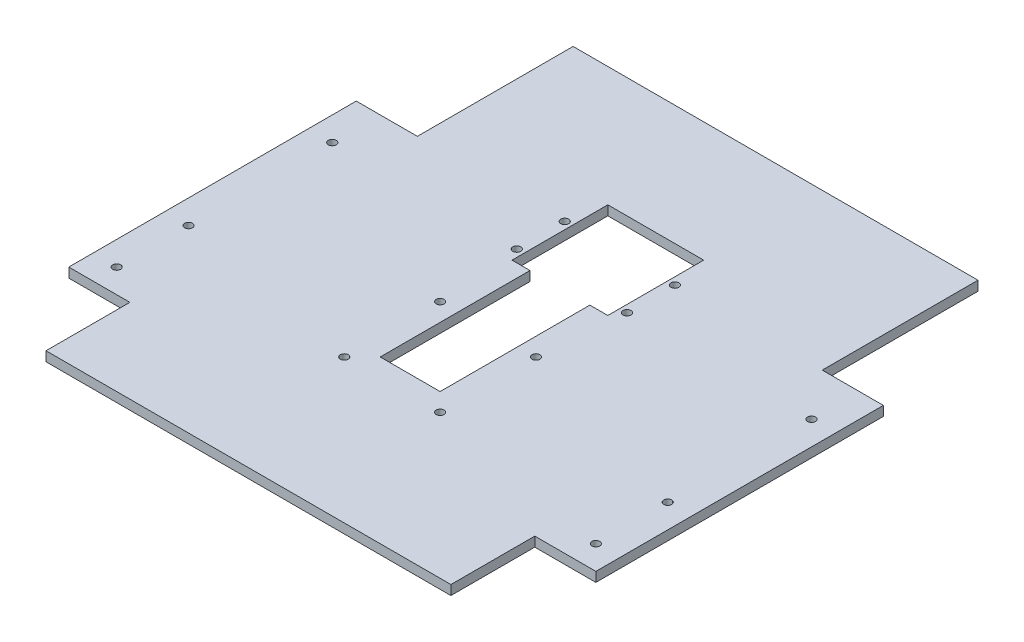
ISO-10303-21;
HEADER;
FILE_DESCRIPTION(('STEP AP214'),'2;1');
FILE_NAME('part.step','',(''),(''),'','','');
FILE_SCHEMA(('AUTOMOTIVE_DESIGN { 1 0 10303 214 1 1 1 1 }'));
ENDSEC;
DATA;
#1=APPLICATION_CONTEXT('core data for automotive mechanical design processes');
#2=APPLICATION_PROTOCOL_DEFINITION('international standard','automotive_design',2000,#1);
#3=PRODUCT_CONTEXT('',#1,'mechanical');
#4=PRODUCT('Part','Part','',(#3));
#5=PRODUCT_RELATED_PRODUCT_CATEGORY('part','',(#4));
#6=PRODUCT_DEFINITION_FORMATION('','',#4);
#7=PRODUCT_DEFINITION_CONTEXT('part definition',#1,'design');
#8=PRODUCT_DEFINITION('design','',#6,#7);
#9=PRODUCT_DEFINITION_SHAPE('','',#8);
#10=(LENGTH_UNIT() NAMED_UNIT(*) SI_UNIT(.MILLI.,.METRE.));
#11=(NAMED_UNIT(*) PLANE_ANGLE_UNIT() SI_UNIT($,.RADIAN.));
#12=(NAMED_UNIT(*) SI_UNIT($,.STERADIAN.) SOLID_ANGLE_UNIT());
#13=UNCERTAINTY_MEASURE_WITH_UNIT(LENGTH_MEASURE(1.E-05),#10,'distance_accuracy_value','');
#14=(GEOMETRIC_REPRESENTATION_CONTEXT(3) GLOBAL_UNCERTAINTY_ASSIGNED_CONTEXT((#13)) GLOBAL_UNIT_ASSIGNED_CONTEXT((#10,
#11,#12)) REPRESENTATION_CONTEXT('',''));
#15=CARTESIAN_POINT('',(0.,0.,0.));
#16=DIRECTION('',(0.,0.,1.));
#17=DIRECTION('',(1.,0.,0.));
#18=AXIS2_PLACEMENT_3D('',#15,#16,#17);
#19=CARTESIAN_POINT('',(0.,-146.,42.5));
#20=DIRECTION('',(0.,0.,1.));
#21=DIRECTION('',(1.,0.,0.));
#22=AXIS2_PLACEMENT_3D('',#19,#20,#21);
#23=PLANE('',#22);
#24=DIRECTION('',(-1.,0.,0.));
#25=VECTOR('',#24,1.);
#26=CARTESIAN_POINT('',(0.,0.,42.5));
#27=LINE('',#26,#25);
#28=CARTESIAN_POINT('',(12.5,0.,42.5));
#29=VERTEX_POINT('',#28);
#30=CARTESIAN_POINT('',(-12.5,0.,42.5));
#31=VERTEX_POINT('',#30);
#32=EDGE_CURVE('E430',#29,#31,#27,.T.);
#33=ORIENTED_EDGE('',*,*,#32,.T.);
#34=DIRECTION('',(0.,1.,0.));
#35=VECTOR('',#34,1.);
#36=CARTESIAN_POINT('',(-12.5,-146.,42.5));
#37=LINE('',#36,#35);
#38=CARTESIAN_POINT('',(-12.5,4.,42.5));
#39=VERTEX_POINT('',#38);
#40=EDGE_CURVE('E26',#31,#39,#37,.T.);
#41=ORIENTED_EDGE('',*,*,#40,.T.);
#42=DIRECTION('',(1.,0.,0.));
#43=VECTOR('',#42,1.);
#44=CARTESIAN_POINT('',(0.,4.,42.5));
#45=LINE('',#44,#43);
#46=CARTESIAN_POINT('',(12.5,4.,42.5));
#47=VERTEX_POINT('',#46);
#48=EDGE_CURVE('E393',#39,#47,#45,.T.);
#49=ORIENTED_EDGE('',*,*,#48,.T.);
#50=DIRECTION('',(0.,1.,0.));
#51=VECTOR('',#50,1.);
#52=CARTESIAN_POINT('',(12.5,-146.,42.5));
#53=LINE('',#52,#51);
#54=EDGE_CURVE('E11',#29,#47,#53,.T.);
#55=ORIENTED_EDGE('',*,*,#54,.F.);
#56=EDGE_LOOP('',(#33,#41,#49,#55));
#57=FACE_BOUND('',#56,.T.);
#58=ADVANCED_FACE('F17',(#57),#23,.F.);
#59=CARTESIAN_POINT('',(12.5,-146.,0.));
#60=DIRECTION('',(1.,0.,0.));
#61=DIRECTION('',(0.,0.,1.));
#62=AXIS2_PLACEMENT_3D('',#59,#60,#61);
#63=PLANE('',#62);
#64=DIRECTION('',(0.,0.,1.));
#65=VECTOR('',#64,1.);
#66=CARTESIAN_POINT('',(12.5,0.,0.));
#67=LINE('',#66,#65);
#68=CARTESIAN_POINT('',(12.5,0.,-20.));
#69=VERTEX_POINT('',#68);
#70=EDGE_CURVE('E271',#69,#29,#67,.T.);
#71=ORIENTED_EDGE('',*,*,#70,.T.);
#72=ORIENTED_EDGE('',*,*,#54,.T.);
#73=DIRECTION('',(0.,0.,-1.));
#74=VECTOR('',#73,1.);
#75=CARTESIAN_POINT('',(12.5,4.,0.));
#76=LINE('',#75,#74);
#77=CARTESIAN_POINT('',(12.5,4.,-20.));
#78=VERTEX_POINT('',#77);
#79=EDGE_CURVE('E288',#47,#78,#76,.T.);
#80=ORIENTED_EDGE('',*,*,#79,.T.);
#81=DIRECTION('',(0.,1.,0.));
#82=VECTOR('',#81,1.);
#83=CARTESIAN_POINT('',(12.5,0.,-20.));
#84=LINE('',#83,#82);
#85=EDGE_CURVE('E476',#69,#78,#84,.T.);
#86=ORIENTED_EDGE('',*,*,#85,.F.);
#87=EDGE_LOOP('',(#71,#72,#80,#86));
#88=FACE_BOUND('',#87,.T.);
#89=ADVANCED_FACE('F520',(#88),#63,.F.);
#90=CARTESIAN_POINT('',(-12.5,-146.,0.));
#91=DIRECTION('',(1.,0.,0.));
#92=DIRECTION('',(0.,1.,0.));
#93=AXIS2_PLACEMENT_3D('',#90,#91,#92);
#94=PLANE('',#93);
#95=DIRECTION('',(0.,1.,0.));
#96=VECTOR('',#95,1.);
#97=CARTESIAN_POINT('',(-12.5,0.,-20.));
#98=LINE('',#97,#96);
#99=CARTESIAN_POINT('',(-12.5,0.,-20.));
#100=VERTEX_POINT('',#99);
#101=CARTESIAN_POINT('',(-12.5,4.,-20.));
#102=VERTEX_POINT('',#101);
#103=EDGE_CURVE('E258',#100,#102,#98,.T.);
#104=ORIENTED_EDGE('',*,*,#103,.T.);
#105=DIRECTION('',(0.,0.,-1.));
#106=VECTOR('',#105,1.);
#107=CARTESIAN_POINT('',(-12.5,4.,0.));
#108=LINE('',#107,#106);
#109=EDGE_CURVE('E372',#39,#102,#108,.T.);
#110=ORIENTED_EDGE('',*,*,#109,.F.);
#111=ORIENTED_EDGE('',*,*,#40,.F.);
#112=DIRECTION('',(0.,0.,1.));
#113=VECTOR('',#112,1.);
#114=CARTESIAN_POINT('',(-12.5,0.,0.));
#115=LINE('',#114,#113);
#116=EDGE_CURVE('E426',#100,#31,#115,.T.);
#117=ORIENTED_EDGE('',*,*,#116,.F.);
#118=EDGE_LOOP('',(#104,#110,#111,#117));
#119=FACE_BOUND('',#118,.T.);
#120=ADVANCED_FACE('F498',(#119),#94,.T.);
#121=CARTESIAN_POINT('',(-20.,0.,-60.));
#122=DIRECTION('',(0.,0.,-1.));
#123=DIRECTION('',(0.,-1.,0.));
#124=AXIS2_PLACEMENT_3D('',#121,#122,#123);
#125=PLANE('',#124);
#126=DIRECTION('',(-1.,0.,0.));
#127=VECTOR('',#126,1.);
#128=CARTESIAN_POINT('',(-20.,4.,-60.));
#129=LINE('',#128,#127);
#130=CARTESIAN_POINT('',(20.,4.,-60.));
#131=VERTEX_POINT('',#130);
#132=CARTESIAN_POINT('',(-20.,4.,-60.));
#133=VERTEX_POINT('',#132);
#134=EDGE_CURVE('E384',#131,#133,#129,.T.);
#135=ORIENTED_EDGE('',*,*,#134,.T.);
#136=DIRECTION('',(0.,1.,0.));
#137=VECTOR('',#136,1.);
#138=CARTESIAN_POINT('',(-20.,0.,-60.));
#139=LINE('',#138,#137);
#140=CARTESIAN_POINT('',(-20.,0.,-60.));
#141=VERTEX_POINT('',#140);
#142=EDGE_CURVE('E39',#141,#133,#139,.T.);
#143=ORIENTED_EDGE('',*,*,#142,.F.);
#144=DIRECTION('',(-1.,0.,0.));
#145=VECTOR('',#144,1.);
#146=CARTESIAN_POINT('',(-20.,0.,-60.));
#147=LINE('',#146,#145);
#148=CARTESIAN_POINT('',(20.,0.,-60.));
#149=VERTEX_POINT('',#148);
#150=EDGE_CURVE('E259',#149,#141,#147,.T.);
#151=ORIENTED_EDGE('',*,*,#150,.F.);
#152=DIRECTION('',(0.,1.,0.));
#153=VECTOR('',#152,1.);
#154=CARTESIAN_POINT('',(20.,0.,-60.));
#155=LINE('',#154,#153);
#156=EDGE_CURVE('E470',#149,#131,#155,.T.);
#157=ORIENTED_EDGE('',*,*,#156,.T.);
#158=EDGE_LOOP('',(#135,#143,#151,#157));
#159=FACE_BOUND('',#158,.T.);
#160=ADVANCED_FACE('F508',(#159),#125,.F.);
#161=CARTESIAN_POINT('',(-20.,0.,-20.));
#162=DIRECTION('',(-1.,0.,0.));
#163=DIRECTION('',(0.,0.,1.));
#164=AXIS2_PLACEMENT_3D('',#161,#162,#163);
#165=PLANE('',#164);
#166=DIRECTION('',(0.,0.,1.));
#167=VECTOR('',#166,1.);
#168=CARTESIAN_POINT('',(-20.,4.,-20.));
#169=LINE('',#168,#167);
#170=CARTESIAN_POINT('',(-20.,4.,-20.));
#171=VERTEX_POINT('',#170);
#172=EDGE_CURVE('E380',#133,#171,#169,.T.);
#173=ORIENTED_EDGE('',*,*,#172,.T.);
#174=DIRECTION('',(0.,1.,0.));
#175=VECTOR('',#174,1.);
#176=CARTESIAN_POINT('',(-20.,0.,-20.));
#177=LINE('',#176,#175);
#178=CARTESIAN_POINT('',(-20.,0.,-20.));
#179=VERTEX_POINT('',#178);
#180=EDGE_CURVE('E193',#179,#171,#177,.T.);
#181=ORIENTED_EDGE('',*,*,#180,.F.);
#182=DIRECTION('',(0.,0.,1.));
#183=VECTOR('',#182,1.);
#184=CARTESIAN_POINT('',(-20.,0.,-20.));
#185=LINE('',#184,#183);
#186=EDGE_CURVE('E254',#141,#179,#185,.T.);
#187=ORIENTED_EDGE('',*,*,#186,.F.);
#188=ORIENTED_EDGE('',*,*,#142,.T.);
#189=EDGE_LOOP('',(#173,#181,#187,#188));
#190=FACE_BOUND('',#189,.T.);
#191=ADVANCED_FACE('F507',(#190),#165,.F.);
#192=CARTESIAN_POINT('',(-20.,0.,-20.));
#193=DIRECTION('',(0.,0.,1.));
#194=DIRECTION('',(1.,0.,0.));
#195=AXIS2_PLACEMENT_3D('',#192,#193,#194);
#196=PLANE('',#195);
#197=DIRECTION('',(1.,0.,0.));
#198=VECTOR('',#197,1.);
#199=CARTESIAN_POINT('',(-20.,0.,-20.));
#200=LINE('',#199,#198);
#201=CARTESIAN_POINT('',(20.,0.,-20.));
#202=VERTEX_POINT('',#201);
#203=EDGE_CURVE('E266',#69,#202,#200,.T.);
#204=ORIENTED_EDGE('',*,*,#203,.F.);
#205=ORIENTED_EDGE('',*,*,#85,.T.);
#206=DIRECTION('',(1.,0.,0.));
#207=VECTOR('',#206,1.);
#208=CARTESIAN_POINT('',(-20.,4.,-20.));
#209=LINE('',#208,#207);
#210=CARTESIAN_POINT('',(20.,4.,-20.));
#211=VERTEX_POINT('',#210);
#212=EDGE_CURVE('E284',#78,#211,#209,.T.);
#213=ORIENTED_EDGE('',*,*,#212,.T.);
#214=DIRECTION('',(0.,1.,0.));
#215=VECTOR('',#214,1.);
#216=CARTESIAN_POINT('',(20.,0.,-20.));
#217=LINE('',#216,#215);
#218=EDGE_CURVE('E473',#202,#211,#217,.T.);
#219=ORIENTED_EDGE('',*,*,#218,.F.);
#220=EDGE_LOOP('',(#204,#205,#213,#219));
#221=FACE_BOUND('',#220,.T.);
#222=ADVANCED_FACE('F516',(#221),#196,.F.);
#223=CARTESIAN_POINT('',(20.,0.,-20.));
#224=DIRECTION('',(1.,0.,0.));
#225=DIRECTION('',(0.,1.,0.));
#226=AXIS2_PLACEMENT_3D('',#223,#224,#225);
#227=PLANE('',#226);
#228=DIRECTION('',(0.,0.,-1.));
#229=VECTOR('',#228,1.);
#230=CARTESIAN_POINT('',(20.,4.,-20.));
#231=LINE('',#230,#229);
#232=EDGE_CURVE('E289',#211,#131,#231,.T.);
#233=ORIENTED_EDGE('',*,*,#232,.T.);
#234=ORIENTED_EDGE('',*,*,#156,.F.);
#235=DIRECTION('',(0.,0.,-1.));
#236=VECTOR('',#235,1.);
#237=CARTESIAN_POINT('',(20.,0.,-20.));
#238=LINE('',#237,#236);
#239=EDGE_CURVE('E270',#202,#149,#238,.T.);
#240=ORIENTED_EDGE('',*,*,#239,.F.);
#241=ORIENTED_EDGE('',*,*,#218,.T.);
#242=EDGE_LOOP('',(#233,#234,#240,#241));
#243=FACE_BOUND('',#242,.T.);
#244=ADVANCED_FACE('F512',(#243),#227,.F.);
#245=CARTESIAN_POINT('',(84.5,-16.,0.));
#246=DIRECTION('',(-1.,0.,0.));
#247=DIRECTION('',(0.,1.,0.));
#248=AXIS2_PLACEMENT_3D('',#245,#246,#247);
#249=PLANE('',#248);
#250=DIRECTION('',(0.,0.,-1.));
#251=VECTOR('',#250,1.);
#252=CARTESIAN_POINT('',(84.5,0.,0.));
#253=LINE('',#252,#251);
#254=CARTESIAN_POINT('',(84.5,0.,-45.));
#255=VERTEX_POINT('',#254);
#256=CARTESIAN_POINT('',(84.5,0.,-110.));
#257=VERTEX_POINT('',#256);
#258=EDGE_CURVE('E217',#255,#257,#253,.T.);
#259=ORIENTED_EDGE('',*,*,#258,.T.);
#260=DIRECTION('',(0.,-1.,0.));
#261=VECTOR('',#260,1.);
#262=CARTESIAN_POINT('',(84.5,4.,-110.));
#263=LINE('',#262,#261);
#264=CARTESIAN_POINT('',(84.5,4.,-110.));
#265=VERTEX_POINT('',#264);
#266=EDGE_CURVE('E443',#265,#257,#263,.T.);
#267=ORIENTED_EDGE('',*,*,#266,.F.);
#268=DIRECTION('',(0.,0.,1.));
#269=VECTOR('',#268,1.);
#270=CARTESIAN_POINT('',(84.5,4.,0.));
#271=LINE('',#270,#269);
#272=CARTESIAN_POINT('',(84.5,4.,-45.));
#273=VERTEX_POINT('',#272);
#274=EDGE_CURVE('E368',#265,#273,#271,.T.);
#275=ORIENTED_EDGE('',*,*,#274,.T.);
#276=DIRECTION('',(0.,1.,0.));
#277=VECTOR('',#276,1.);
#278=CARTESIAN_POINT('',(84.5,-16.,-45.));
#279=LINE('',#278,#277);
#280=EDGE_CURVE('E467',#255,#273,#279,.T.);
#281=ORIENTED_EDGE('',*,*,#280,.F.);
#282=EDGE_LOOP('',(#259,#267,#275,#281));
#283=FACE_BOUND('',#282,.T.);
#284=ADVANCED_FACE('F1479',(#283),#249,.F.);
#285=CARTESIAN_POINT('',(0.,-16.,-45.));
#286=DIRECTION('',(0.,0.,-1.));
#287=DIRECTION('',(0.,-1.,0.));
#288=AXIS2_PLACEMENT_3D('',#285,#286,#287);
#289=PLANE('',#288);
#290=ORIENTED_EDGE('',*,*,#280,.T.);
#291=DIRECTION('',(-1.,0.,0.));
#292=VECTOR('',#291,1.);
#293=CARTESIAN_POINT('',(0.,4.,-45.));
#294=LINE('',#293,#292);
#295=CARTESIAN_POINT('',(110.,4.,-45.));
#296=VERTEX_POINT('',#295);
#297=EDGE_CURVE('E329',#296,#273,#294,.T.);
#298=ORIENTED_EDGE('',*,*,#297,.F.);
#299=DIRECTION('',(0.,1.,0.));
#300=VECTOR('',#299,1.);
#301=CARTESIAN_POINT('',(110.,-16.,-45.));
#302=LINE('',#301,#300);
#303=CARTESIAN_POINT('',(110.,0.,-45.));
#304=VERTEX_POINT('',#303);
#305=EDGE_CURVE('E192',#304,#296,#302,.T.);
#306=ORIENTED_EDGE('',*,*,#305,.F.);
#307=DIRECTION('',(1.,0.,0.));
#308=VECTOR('',#307,1.);
#309=CARTESIAN_POINT('',(0.,0.,-45.));
#310=LINE('',#309,#308);
#311=EDGE_CURVE('E210',#255,#304,#310,.T.);
#312=ORIENTED_EDGE('',*,*,#311,.F.);
#313=EDGE_LOOP('',(#290,#298,#306,#312));
#314=FACE_BOUND('',#313,.T.);
#315=ADVANCED_FACE('F1582',(#314),#289,.T.);
#316=CARTESIAN_POINT('',(0.,-16.,-45.));
#317=DIRECTION('',(0.,0.,1.));
#318=DIRECTION('',(1.,0.,0.));
#319=AXIS2_PLACEMENT_3D('',#316,#317,#318);
#320=PLANE('',#319);
#321=DIRECTION('',(-1.,0.,0.));
#322=VECTOR('',#321,1.);
#323=CARTESIAN_POINT('',(0.,0.,-45.));
#324=LINE('',#323,#322);
#325=CARTESIAN_POINT('',(-84.5,0.,-45.));
#326=VERTEX_POINT('',#325);
#327=CARTESIAN_POINT('',(-110.,0.,-45.));
#328=VERTEX_POINT('',#327);
#329=EDGE_CURVE('E403',#326,#328,#324,.T.);
#330=ORIENTED_EDGE('',*,*,#329,.T.);
#331=DIRECTION('',(0.,-1.,0.));
#332=VECTOR('',#331,1.);
#333=CARTESIAN_POINT('',(-110.,4.,-45.));
#334=LINE('',#333,#332);
#335=CARTESIAN_POINT('',(-110.,4.,-45.));
#336=VERTEX_POINT('',#335);
#337=EDGE_CURVE('E452',#336,#328,#334,.T.);
#338=ORIENTED_EDGE('',*,*,#337,.F.);
#339=DIRECTION('',(1.,0.,0.));
#340=VECTOR('',#339,1.);
#341=CARTESIAN_POINT('',(0.,4.,-45.));
#342=LINE('',#341,#340);
#343=CARTESIAN_POINT('',(-84.5,4.,-45.));
#344=VERTEX_POINT('',#343);
#345=EDGE_CURVE('E233',#336,#344,#342,.T.);
#346=ORIENTED_EDGE('',*,*,#345,.T.);
#347=DIRECTION('',(0.,1.,0.));
#348=VECTOR('',#347,1.);
#349=CARTESIAN_POINT('',(-84.5,-16.,-45.));
#350=LINE('',#349,#348);
#351=EDGE_CURVE('E464',#326,#344,#350,.T.);
#352=ORIENTED_EDGE('',*,*,#351,.F.);
#353=EDGE_LOOP('',(#330,#338,#346,#352));
#354=FACE_BOUND('',#353,.T.);
#355=ADVANCED_FACE('F1571',(#354),#320,.F.);
#356=CARTESIAN_POINT('',(-84.5,-16.,0.));
#357=DIRECTION('',(-1.,0.,0.));
#358=DIRECTION('',(0.,0.,1.));
#359=AXIS2_PLACEMENT_3D('',#356,#357,#358);
#360=PLANE('',#359);
#361=ORIENTED_EDGE('',*,*,#351,.T.);
#362=DIRECTION('',(0.,0.,1.));
#363=VECTOR('',#362,1.);
#364=CARTESIAN_POINT('',(-84.5,4.,0.));
#365=LINE('',#364,#363);
#366=CARTESIAN_POINT('',(-84.5,4.,-110.));
#367=VERTEX_POINT('',#366);
#368=EDGE_CURVE('E238',#367,#344,#365,.T.);
#369=ORIENTED_EDGE('',*,*,#368,.F.);
#370=DIRECTION('',(0.,1.,0.));
#371=VECTOR('',#370,1.);
#372=CARTESIAN_POINT('',(-84.5,-16.,-110.));
#373=LINE('',#372,#371);
#374=CARTESIAN_POINT('',(-84.5,0.,-110.));
#375=VERTEX_POINT('',#374);
#376=EDGE_CURVE('E446',#375,#367,#373,.T.);
#377=ORIENTED_EDGE('',*,*,#376,.F.);
#378=DIRECTION('',(0.,0.,-1.));
#379=VECTOR('',#378,1.);
#380=CARTESIAN_POINT('',(-84.5,0.,0.));
#381=LINE('',#380,#379);
#382=EDGE_CURVE('E354',#326,#375,#381,.T.);
#383=ORIENTED_EDGE('',*,*,#382,.F.);
#384=EDGE_LOOP('',(#361,#369,#377,#383));
#385=FACE_BOUND('',#384,.T.);
#386=ADVANCED_FACE('F1560',(#385),#360,.T.);
#387=CARTESIAN_POINT('',(-84.5,-16.,0.));
#388=DIRECTION('',(1.,0.,0.));
#389=DIRECTION('',(0.,0.,-1.));
#390=AXIS2_PLACEMENT_3D('',#387,#388,#389);
#391=PLANE('',#390);
#392=DIRECTION('',(0.,0.,1.));
#393=VECTOR('',#392,1.);
#394=CARTESIAN_POINT('',(-84.5,0.,0.));
#395=LINE('',#394,#393);
#396=CARTESIAN_POINT('',(-84.5,0.,75.));
#397=VERTEX_POINT('',#396);
#398=CARTESIAN_POINT('',(-84.5,0.,110.));
#399=VERTEX_POINT('',#398);
#400=EDGE_CURVE('E244',#397,#399,#395,.T.);
#401=ORIENTED_EDGE('',*,*,#400,.T.);
#402=DIRECTION('',(0.,-1.,0.));
#403=VECTOR('',#402,1.);
#404=CARTESIAN_POINT('',(-84.5,4.,110.));
#405=LINE('',#404,#403);
#406=CARTESIAN_POINT('',(-84.5,4.,110.));
#407=VERTEX_POINT('',#406);
#408=EDGE_CURVE('E455',#407,#399,#405,.T.);
#409=ORIENTED_EDGE('',*,*,#408,.F.);
#410=DIRECTION('',(0.,0.,-1.));
#411=VECTOR('',#410,1.);
#412=CARTESIAN_POINT('',(-84.5,4.,0.));
#413=LINE('',#412,#411);
#414=CARTESIAN_POINT('',(-84.5,4.,75.));
#415=VERTEX_POINT('',#414);
#416=EDGE_CURVE('E346',#407,#415,#413,.T.);
#417=ORIENTED_EDGE('',*,*,#416,.T.);
#418=DIRECTION('',(0.,1.,0.));
#419=VECTOR('',#418,1.);
#420=CARTESIAN_POINT('',(-84.5,-16.,75.));
#421=LINE('',#420,#419);
#422=EDGE_CURVE('E461',#397,#415,#421,.T.);
#423=ORIENTED_EDGE('',*,*,#422,.F.);
#424=EDGE_LOOP('',(#401,#409,#417,#423));
#425=FACE_BOUND('',#424,.T.);
#426=ADVANCED_FACE('F1549',(#425),#391,.F.);
#427=CARTESIAN_POINT('',(0.,-16.,75.));
#428=DIRECTION('',(0.,0.,1.));
#429=DIRECTION('',(1.,0.,0.));
#430=AXIS2_PLACEMENT_3D('',#427,#428,#429);
#431=PLANE('',#430);
#432=ORIENTED_EDGE('',*,*,#422,.T.);
#433=DIRECTION('',(1.,0.,0.));
#434=VECTOR('',#433,1.);
#435=CARTESIAN_POINT('',(0.,4.,75.));
#436=LINE('',#435,#434);
#437=CARTESIAN_POINT('',(-110.,4.,75.));
#438=VERTEX_POINT('',#437);
#439=EDGE_CURVE('E341',#438,#415,#436,.T.);
#440=ORIENTED_EDGE('',*,*,#439,.F.);
#441=DIRECTION('',(0.,1.,0.));
#442=VECTOR('',#441,1.);
#443=CARTESIAN_POINT('',(-110.,-16.,75.));
#444=LINE('',#443,#442);
#445=CARTESIAN_POINT('',(-110.,0.,75.));
#446=VERTEX_POINT('',#445);
#447=EDGE_CURVE('E449',#446,#438,#444,.T.);
#448=ORIENTED_EDGE('',*,*,#447,.F.);
#449=DIRECTION('',(-1.,0.,0.));
#450=VECTOR('',#449,1.);
#451=CARTESIAN_POINT('',(0.,0.,75.));
#452=LINE('',#451,#450);
#453=EDGE_CURVE('E239',#397,#446,#452,.T.);
#454=ORIENTED_EDGE('',*,*,#453,.F.);
#455=EDGE_LOOP('',(#432,#440,#448,#454));
#456=FACE_BOUND('',#455,.T.);
#457=ADVANCED_FACE('F1539',(#456),#431,.T.);
#458=CARTESIAN_POINT('',(0.,-16.,75.));
#459=DIRECTION('',(0.,0.,-1.));
#460=DIRECTION('',(0.,-1.,0.));
#461=AXIS2_PLACEMENT_3D('',#458,#459,#460);
#462=PLANE('',#461);
#463=DIRECTION('',(1.,0.,0.));
#464=VECTOR('',#463,1.);
#465=CARTESIAN_POINT('',(0.,0.,75.));
#466=LINE('',#465,#464);
#467=CARTESIAN_POINT('',(84.5,0.,75.));
#468=VERTEX_POINT('',#467);
#469=CARTESIAN_POINT('',(110.,0.,75.));
#470=VERTEX_POINT('',#469);
#471=EDGE_CURVE('E196',#468,#470,#466,.T.);
#472=ORIENTED_EDGE('',*,*,#471,.T.);
#473=DIRECTION('',(0.,1.,0.));
#474=VECTOR('',#473,1.);
#475=CARTESIAN_POINT('',(110.,-16.,75.));
#476=LINE('',#475,#474);
#477=CARTESIAN_POINT('',(110.,4.,75.));
#478=VERTEX_POINT('',#477);
#479=EDGE_CURVE('E180',#470,#478,#476,.T.);
#480=ORIENTED_EDGE('',*,*,#479,.T.);
#481=DIRECTION('',(-1.,0.,0.));
#482=VECTOR('',#481,1.);
#483=CARTESIAN_POINT('',(0.,4.,75.));
#484=LINE('',#483,#482);
#485=CARTESIAN_POINT('',(84.5,4.,75.));
#486=VERTEX_POINT('',#485);
#487=EDGE_CURVE('E302',#478,#486,#484,.T.);
#488=ORIENTED_EDGE('',*,*,#487,.T.);
#489=DIRECTION('',(0.,1.,0.));
#490=VECTOR('',#489,1.);
#491=CARTESIAN_POINT('',(84.5,-16.,75.));
#492=LINE('',#491,#490);
#493=EDGE_CURVE('E199',#468,#486,#492,.T.);
#494=ORIENTED_EDGE('',*,*,#493,.F.);
#495=EDGE_LOOP('',(#472,#480,#488,#494));
#496=FACE_BOUND('',#495,.T.);
#497=ADVANCED_FACE('F197',(#496),#462,.F.);
#498=CARTESIAN_POINT('',(84.5,-16.,0.));
#499=DIRECTION('',(1.,0.,0.));
#500=DIRECTION('',(0.,1.,0.));
#501=AXIS2_PLACEMENT_3D('',#498,#499,#500);
#502=PLANE('',#501);
#503=ORIENTED_EDGE('',*,*,#493,.T.);
#504=DIRECTION('',(0.,0.,-1.));
#505=VECTOR('',#504,1.);
#506=CARTESIAN_POINT('',(84.5,4.,0.));
#507=LINE('',#506,#505);
#508=CARTESIAN_POINT('',(84.5,4.,110.));
#509=VERTEX_POINT('',#508);
#510=EDGE_CURVE('E305',#509,#486,#507,.T.);
#511=ORIENTED_EDGE('',*,*,#510,.F.);
#512=DIRECTION('',(0.,-1.,0.));
#513=VECTOR('',#512,1.);
#514=CARTESIAN_POINT('',(84.5,4.,110.));
#515=LINE('',#514,#513);
#516=CARTESIAN_POINT('',(84.5,0.,110.));
#517=VERTEX_POINT('',#516);
#518=EDGE_CURVE('E458',#509,#517,#515,.T.);
#519=ORIENTED_EDGE('',*,*,#518,.T.);
#520=DIRECTION('',(0.,0.,1.));
#521=VECTOR('',#520,1.);
#522=CARTESIAN_POINT('',(84.5,0.,0.));
#523=LINE('',#522,#521);
#524=EDGE_CURVE('E204',#468,#517,#523,.T.);
#525=ORIENTED_EDGE('',*,*,#524,.F.);
#526=EDGE_LOOP('',(#503,#511,#519,#525));
#527=FACE_BOUND('',#526,.T.);
#528=ADVANCED_FACE('F1500',(#527),#502,.T.);
#529=CARTESIAN_POINT('',(-110.,4.,110.));
#530=DIRECTION('',(0.,0.,-1.));
#531=DIRECTION('',(0.,-1.,0.));
#532=AXIS2_PLACEMENT_3D('',#529,#530,#531);
#533=PLANE('',#532);
#534=DIRECTION('',(1.,0.,0.));
#535=VECTOR('',#534,1.);
#536=CARTESIAN_POINT('',(-110.,4.,110.));
#537=LINE('',#536,#535);
#538=EDGE_CURVE('E342',#407,#509,#537,.T.);
#539=ORIENTED_EDGE('',*,*,#538,.F.);
#540=ORIENTED_EDGE('',*,*,#408,.T.);
#541=DIRECTION('',(1.,0.,0.));
#542=VECTOR('',#541,1.);
#543=CARTESIAN_POINT('',(-110.,0.,110.));
#544=LINE('',#543,#542);
#545=EDGE_CURVE('E415',#399,#517,#544,.T.);
#546=ORIENTED_EDGE('',*,*,#545,.T.);
#547=ORIENTED_EDGE('',*,*,#518,.F.);
#548=EDGE_LOOP('',(#539,#540,#546,#547));
#549=FACE_BOUND('',#548,.T.);
#550=ADVANCED_FACE('F1489',(#549),#533,.F.);
#551=CARTESIAN_POINT('',(-110.,4.,110.));
#552=DIRECTION('',(1.,0.,0.));
#553=DIRECTION('',(0.,1.,0.));
#554=AXIS2_PLACEMENT_3D('',#551,#552,#553);
#555=PLANE('',#554);
#556=ORIENTED_EDGE('',*,*,#447,.T.);
#557=DIRECTION('',(0.,0.,1.));
#558=VECTOR('',#557,1.);
#559=CARTESIAN_POINT('',(-110.,4.,110.));
#560=LINE('',#559,#558);
#561=EDGE_CURVE('E237',#336,#438,#560,.T.);
#562=ORIENTED_EDGE('',*,*,#561,.F.);
#563=ORIENTED_EDGE('',*,*,#337,.T.);
#564=DIRECTION('',(0.,0.,1.));
#565=VECTOR('',#564,1.);
#566=CARTESIAN_POINT('',(-110.,0.,110.));
#567=LINE('',#566,#565);
#568=EDGE_CURVE('E243',#328,#446,#567,.T.);
#569=ORIENTED_EDGE('',*,*,#568,.T.);
#570=EDGE_LOOP('',(#556,#562,#563,#569));
#571=FACE_BOUND('',#570,.T.);
#572=ADVANCED_FACE('F1467',(#571),#555,.F.);
#573=CARTESIAN_POINT('',(-110.,4.,-110.));
#574=DIRECTION('',(0.,0.,1.));
#575=DIRECTION('',(1.,0.,0.));
#576=AXIS2_PLACEMENT_3D('',#573,#574,#575);
#577=PLANE('',#576);
#578=DIRECTION('',(-1.,0.,0.));
#579=VECTOR('',#578,1.);
#580=CARTESIAN_POINT('',(-110.,4.,-110.));
#581=LINE('',#580,#579);
#582=EDGE_CURVE('E364',#265,#367,#581,.T.);
#583=ORIENTED_EDGE('',*,*,#582,.F.);
#584=ORIENTED_EDGE('',*,*,#266,.T.);
#585=DIRECTION('',(-1.,0.,0.));
#586=VECTOR('',#585,1.);
#587=CARTESIAN_POINT('',(-110.,0.,-110.));
#588=LINE('',#587,#586);
#589=EDGE_CURVE('E350',#257,#375,#588,.T.);
#590=ORIENTED_EDGE('',*,*,#589,.T.);
#591=ORIENTED_EDGE('',*,*,#376,.T.);
#592=EDGE_LOOP('',(#583,#584,#590,#591));
#593=FACE_BOUND('',#592,.T.);
#594=ADVANCED_FACE('F1412',(#593),#577,.F.);
#595=CARTESIAN_POINT('',(110.,4.,110.));
#596=DIRECTION('',(-1.,0.,0.));
#597=DIRECTION('',(0.,0.,1.));
#598=AXIS2_PLACEMENT_3D('',#595,#596,#597);
#599=PLANE('',#598);
#600=DIRECTION('',(0.,0.,-1.));
#601=VECTOR('',#600,1.);
#602=CARTESIAN_POINT('',(110.,4.,110.));
#603=LINE('',#602,#601);
#604=EDGE_CURVE('E187',#478,#296,#603,.T.);
#605=ORIENTED_EDGE('',*,*,#604,.F.);
#606=ORIENTED_EDGE('',*,*,#479,.F.);
#607=DIRECTION('',(0.,0.,-1.));
#608=VECTOR('',#607,1.);
#609=CARTESIAN_POINT('',(110.,0.,110.));
#610=LINE('',#609,#608);
#611=EDGE_CURVE('E184',#470,#304,#610,.T.);
#612=ORIENTED_EDGE('',*,*,#611,.T.);
#613=ORIENTED_EDGE('',*,*,#305,.T.);
#614=EDGE_LOOP('',(#605,#606,#612,#613));
#615=FACE_BOUND('',#614,.T.);
#616=ADVANCED_FACE('F182',(#615),#599,.F.);
#617=CARTESIAN_POINT('',(-20.,0.,-20.));
#618=DIRECTION('',(0.,0.,1.));
#619=DIRECTION('',(1.,0.,0.));
#620=AXIS2_PLACEMENT_3D('',#617,#618,#619);
#621=PLANE('',#620);
#622=ORIENTED_EDGE('',*,*,#103,.F.);
#623=DIRECTION('',(1.,0.,0.));
#624=VECTOR('',#623,1.);
#625=CARTESIAN_POINT('',(-20.,0.,-20.));
#626=LINE('',#625,#624);
#627=EDGE_CURVE('E419',#179,#100,#626,.T.);
#628=ORIENTED_EDGE('',*,*,#627,.F.);
#629=ORIENTED_EDGE('',*,*,#180,.T.);
#630=DIRECTION('',(1.,0.,0.));
#631=VECTOR('',#630,1.);
#632=CARTESIAN_POINT('',(-20.,4.,-20.));
#633=LINE('',#632,#631);
#634=EDGE_CURVE('E376',#171,#102,#633,.T.);
#635=ORIENTED_EDGE('',*,*,#634,.T.);
#636=EDGE_LOOP('',(#622,#628,#629,#635));
#637=FACE_BOUND('',#636,.T.);
#638=ADVANCED_FACE('F502',(#637),#621,.F.);
#639=CARTESIAN_POINT('',(0.,0.,0.));
#640=DIRECTION('',(0.,-1.,0.));
#641=DIRECTION('',(0.,0.,-1.));
#642=AXIS2_PLACEMENT_3D('',#639,#640,#641);
#643=PLANE('',#642);
#644=ORIENTED_EDGE('',*,*,#627,.T.);
#645=ORIENTED_EDGE('',*,*,#116,.T.);
#646=ORIENTED_EDGE('',*,*,#32,.F.);
#647=ORIENTED_EDGE('',*,*,#70,.F.);
#648=ORIENTED_EDGE('',*,*,#203,.T.);
#649=ORIENTED_EDGE('',*,*,#239,.T.);
#650=ORIENTED_EDGE('',*,*,#150,.T.);
#651=ORIENTED_EDGE('',*,*,#186,.T.);
#652=EDGE_LOOP('',(#644,#645,#646,#647,#648,#649,#650,#651));
#653=FACE_BOUND('',#652,.T.);
#654=CARTESIAN_POINT('',(-100.,0.,35.));
#655=DIRECTION('',(0.,1.,0.));
#656=DIRECTION('',(0.,0.,1.));
#657=AXIS2_PLACEMENT_3D('',#654,#655,#656);
#658=CIRCLE('',#657,1.65);
#659=CARTESIAN_POINT('',(-100.,0.,36.65));
#660=VERTEX_POINT('',#659);
#661=EDGE_CURVE('E293',#660,#660,#658,.T.);
#662=ORIENTED_EDGE('',*,*,#661,.T.);
#663=EDGE_LOOP('',(#662));
#664=FACE_BOUND('',#663,.T.);
#665=CARTESIAN_POINT('',(100.,0.,-25.));
#666=DIRECTION('',(0.,1.,0.));
#667=DIRECTION('',(0.,0.,1.));
#668=AXIS2_PLACEMENT_3D('',#665,#666,#667);
#669=CIRCLE('',#668,1.65);
#670=CARTESIAN_POINT('',(100.,0.,-23.35));
#671=VERTEX_POINT('',#670);
#672=EDGE_CURVE('E313',#671,#671,#669,.T.);
#673=ORIENTED_EDGE('',*,*,#672,.T.);
#674=EDGE_LOOP('',(#673));
#675=FACE_BOUND('',#674,.T.);
#676=CARTESIAN_POINT('',(-100.,0.,65.));
#677=DIRECTION('',(0.,1.,0.));
#678=DIRECTION('',(0.,0.,1.));
#679=AXIS2_PLACEMENT_3D('',#676,#677,#678);
#680=CIRCLE('',#679,1.65);
#681=CARTESIAN_POINT('',(-100.,0.,66.65));
#682=VERTEX_POINT('',#681);
#683=EDGE_CURVE('E326',#682,#682,#680,.T.);
#684=ORIENTED_EDGE('',*,*,#683,.T.);
#685=EDGE_LOOP('',(#684));
#686=FACE_BOUND('',#685,.T.);
#687=CARTESIAN_POINT('',(-100.,0.,-25.));
#688=DIRECTION('',(0.,1.,0.));
#689=DIRECTION('',(0.,0.,1.));
#690=AXIS2_PLACEMENT_3D('',#687,#688,#689);
#691=CIRCLE('',#690,1.65);
#692=CARTESIAN_POINT('',(-100.,0.,-23.35));
#693=VERTEX_POINT('',#692);
#694=EDGE_CURVE('E337',#693,#693,#691,.T.);
#695=ORIENTED_EDGE('',*,*,#694,.T.);
#696=EDGE_LOOP('',(#695));
#697=FACE_BOUND('',#696,.T.);
#698=CARTESIAN_POINT('',(100.,0.,65.));
#699=DIRECTION('',(0.,1.,0.));
#700=DIRECTION('',(0.,0.,1.));
#701=AXIS2_PLACEMENT_3D('',#698,#699,#700);
#702=CIRCLE('',#701,1.65);
#703=CARTESIAN_POINT('',(100.,0.,66.65));
#704=VERTEX_POINT('',#703);
#705=EDGE_CURVE('E318',#704,#704,#702,.T.);
#706=ORIENTED_EDGE('',*,*,#705,.T.);
#707=EDGE_LOOP('',(#706));
#708=FACE_BOUND('',#707,.T.);
#709=CARTESIAN_POINT('',(100.,0.,35.));
#710=DIRECTION('',(0.,1.,0.));
#711=DIRECTION('',(0.,0.,1.));
#712=AXIS2_PLACEMENT_3D('',#709,#710,#711);
#713=CIRCLE('',#712,1.65);
#714=CARTESIAN_POINT('',(100.,0.,36.65));
#715=VERTEX_POINT('',#714);
#716=EDGE_CURVE('E301',#715,#715,#713,.T.);
#717=ORIENTED_EDGE('',*,*,#716,.T.);
#718=EDGE_LOOP('',(#717));
#719=FACE_BOUND('',#718,.T.);
#720=CARTESIAN_POINT('',(23.,0.,-45.));
#721=DIRECTION('',(0.,-1.,0.));
#722=DIRECTION('',(0.,0.,-1.));
#723=AXIS2_PLACEMENT_3D('',#720,#721,#722);
#724=CIRCLE('',#723,1.65);
#725=CARTESIAN_POINT('',(23.,0.,-46.65));
#726=VERTEX_POINT('',#725);
#727=EDGE_CURVE('E280',#726,#726,#724,.T.);
#728=ORIENTED_EDGE('',*,*,#727,.F.);
#729=EDGE_LOOP('',(#728));
#730=FACE_BOUND('',#729,.T.);
#731=CARTESIAN_POINT('',(23.,0.,-25.));
#732=DIRECTION('',(0.,-1.,0.));
#733=DIRECTION('',(0.,0.,-1.));
#734=AXIS2_PLACEMENT_3D('',#731,#732,#733);
#735=CIRCLE('',#734,1.65);
#736=CARTESIAN_POINT('',(23.,0.,-26.65));
#737=VERTEX_POINT('',#736);
#738=EDGE_CURVE('E260',#737,#737,#735,.T.);
#739=ORIENTED_EDGE('',*,*,#738,.F.);
#740=EDGE_LOOP('',(#739));
#741=FACE_BOUND('',#740,.T.);
#742=CARTESIAN_POINT('',(-23.,0.,-25.));
#743=DIRECTION('',(0.,-1.,0.));
#744=DIRECTION('',(0.,0.,-1.));
#745=AXIS2_PLACEMENT_3D('',#742,#743,#744);
#746=CIRCLE('',#745,1.65);
#747=CARTESIAN_POINT('',(-23.,0.,-26.65));
#748=VERTEX_POINT('',#747);
#749=EDGE_CURVE('E253',#748,#748,#746,.T.);
#750=ORIENTED_EDGE('',*,*,#749,.F.);
#751=EDGE_LOOP('',(#750));
#752=FACE_BOUND('',#751,.T.);
#753=CARTESIAN_POINT('',(-23.,0.,-45.));
#754=DIRECTION('',(0.,-1.,0.));
#755=DIRECTION('',(0.,0.,-1.));
#756=AXIS2_PLACEMENT_3D('',#753,#754,#755);
#757=CIRCLE('',#756,1.65);
#758=CARTESIAN_POINT('',(-23.,0.,-46.65));
#759=VERTEX_POINT('',#758);
#760=EDGE_CURVE('E245',#759,#759,#757,.T.);
#761=ORIENTED_EDGE('',*,*,#760,.F.);
#762=EDGE_LOOP('',(#761));
#763=FACE_BOUND('',#762,.T.);
#764=CARTESIAN_POINT('',(-20.,0.,10.));
#765=DIRECTION('',(0.,-1.,0.));
#766=DIRECTION('',(0.,0.,-1.));
#767=AXIS2_PLACEMENT_3D('',#764,#765,#766);
#768=CIRCLE('',#767,1.65);
#769=CARTESIAN_POINT('',(-20.,0.,8.35));
#770=VERTEX_POINT('',#769);
#771=EDGE_CURVE('E940',#770,#770,#768,.T.);
#772=ORIENTED_EDGE('',*,*,#771,.F.);
#773=EDGE_LOOP('',(#772));
#774=FACE_BOUND('',#773,.T.);
#775=CARTESIAN_POINT('',(20.,0.,10.));
#776=DIRECTION('',(0.,-1.,0.));
#777=DIRECTION('',(0.,0.,-1.));
#778=AXIS2_PLACEMENT_3D('',#775,#776,#777);
#779=CIRCLE('',#778,1.65);
#780=CARTESIAN_POINT('',(20.,0.,8.35));
#781=VERTEX_POINT('',#780);
#782=EDGE_CURVE('E223',#781,#781,#779,.T.);
#783=ORIENTED_EDGE('',*,*,#782,.F.);
#784=EDGE_LOOP('',(#783));
#785=FACE_BOUND('',#784,.T.);
#786=CARTESIAN_POINT('',(20.,0.,50.));
#787=DIRECTION('',(0.,-1.,0.));
#788=DIRECTION('',(0.,0.,-1.));
#789=AXIS2_PLACEMENT_3D('',#786,#787,#788);
#790=CIRCLE('',#789,1.65);
#791=CARTESIAN_POINT('',(20.,0.,48.35));
#792=VERTEX_POINT('',#791);
#793=EDGE_CURVE('E232',#792,#792,#790,.T.);
#794=ORIENTED_EDGE('',*,*,#793,.F.);
#795=EDGE_LOOP('',(#794));
#796=FACE_BOUND('',#795,.T.);
#797=CARTESIAN_POINT('',(-20.,0.,50.));
#798=DIRECTION('',(0.,-1.,0.));
#799=DIRECTION('',(0.,0.,-1.));
#800=AXIS2_PLACEMENT_3D('',#797,#798,#799);
#801=CIRCLE('',#800,1.65);
#802=CARTESIAN_POINT('',(-20.,0.,48.35));
#803=VERTEX_POINT('',#802);
#804=EDGE_CURVE('E976',#803,#803,#801,.T.);
#805=ORIENTED_EDGE('',*,*,#804,.F.);
#806=EDGE_LOOP('',(#805));
#807=FACE_BOUND('',#806,.T.);
#808=ORIENTED_EDGE('',*,*,#400,.F.);
#809=ORIENTED_EDGE('',*,*,#453,.T.);
#810=ORIENTED_EDGE('',*,*,#568,.F.);
#811=ORIENTED_EDGE('',*,*,#329,.F.);
#812=ORIENTED_EDGE('',*,*,#382,.T.);
#813=ORIENTED_EDGE('',*,*,#589,.F.);
#814=ORIENTED_EDGE('',*,*,#258,.F.);
#815=ORIENTED_EDGE('',*,*,#311,.T.);
#816=ORIENTED_EDGE('',*,*,#611,.F.);
#817=ORIENTED_EDGE('',*,*,#471,.F.);
#818=ORIENTED_EDGE('',*,*,#524,.T.);
#819=ORIENTED_EDGE('',*,*,#545,.F.);
#820=EDGE_LOOP('',(#808,#809,#810,#811,#812,#813,#814,#815,#816,#817,#818,#819));
#821=FACE_BOUND('',#820,.T.);
#822=ADVANCED_FACE('F207',(#653,#664,#675,#686,#697,#708,#719,#730,#741,#752,#763,#774,#785,
#796,#807,#821),#643,.T.);
#823=CARTESIAN_POINT('',(0.,4.,0.));
#824=DIRECTION('',(0.,-1.,0.));
#825=DIRECTION('',(0.,0.,-1.));
#826=AXIS2_PLACEMENT_3D('',#823,#824,#825);
#827=PLANE('',#826);
#828=ORIENTED_EDGE('',*,*,#109,.T.);
#829=ORIENTED_EDGE('',*,*,#634,.F.);
#830=ORIENTED_EDGE('',*,*,#172,.F.);
#831=ORIENTED_EDGE('',*,*,#134,.F.);
#832=ORIENTED_EDGE('',*,*,#232,.F.);
#833=ORIENTED_EDGE('',*,*,#212,.F.);
#834=ORIENTED_EDGE('',*,*,#79,.F.);
#835=ORIENTED_EDGE('',*,*,#48,.F.);
#836=EDGE_LOOP('',(#828,#829,#830,#831,#832,#833,#834,#835));
#837=FACE_BOUND('',#836,.T.);
#838=CARTESIAN_POINT('',(-20.,4.,50.));
#839=DIRECTION('',(0.,1.,0.));
#840=DIRECTION('',(0.,0.,1.));
#841=AXIS2_PLACEMENT_3D('',#838,#839,#840);
#842=CIRCLE('',#841,1.65);
#843=CARTESIAN_POINT('',(-20.,4.,51.65));
#844=VERTEX_POINT('',#843);
#845=EDGE_CURVE('E969',#844,#844,#842,.T.);
#846=ORIENTED_EDGE('',*,*,#845,.F.);
#847=EDGE_LOOP('',(#846));
#848=FACE_BOUND('',#847,.T.);
#849=CARTESIAN_POINT('',(20.,4.,50.));
#850=DIRECTION('',(0.,1.,0.));
#851=DIRECTION('',(0.,0.,1.));
#852=AXIS2_PLACEMENT_3D('',#849,#850,#851);
#853=CIRCLE('',#852,1.65);
#854=CARTESIAN_POINT('',(20.,4.,51.65));
#855=VERTEX_POINT('',#854);
#856=EDGE_CURVE('E228',#855,#855,#853,.T.);
#857=ORIENTED_EDGE('',*,*,#856,.F.);
#858=EDGE_LOOP('',(#857));
#859=FACE_BOUND('',#858,.T.);
#860=CARTESIAN_POINT('',(20.,4.,10.));
#861=DIRECTION('',(0.,1.,0.));
#862=DIRECTION('',(0.,0.,1.));
#863=AXIS2_PLACEMENT_3D('',#860,#861,#862);
#864=CIRCLE('',#863,1.65);
#865=CARTESIAN_POINT('',(20.,4.,11.65));
#866=VERTEX_POINT('',#865);
#867=EDGE_CURVE('E227',#866,#866,#864,.T.);
#868=ORIENTED_EDGE('',*,*,#867,.F.);
#869=EDGE_LOOP('',(#868));
#870=FACE_BOUND('',#869,.T.);
#871=CARTESIAN_POINT('',(-20.,4.,10.));
#872=DIRECTION('',(0.,1.,0.));
#873=DIRECTION('',(0.,0.,1.));
#874=AXIS2_PLACEMENT_3D('',#871,#872,#873);
#875=CIRCLE('',#874,1.65);
#876=CARTESIAN_POINT('',(-20.,4.,11.65));
#877=VERTEX_POINT('',#876);
#878=EDGE_CURVE('E221',#877,#877,#875,.T.);
#879=ORIENTED_EDGE('',*,*,#878,.F.);
#880=EDGE_LOOP('',(#879));
#881=FACE_BOUND('',#880,.T.);
#882=CARTESIAN_POINT('',(-23.,4.,-45.));
#883=DIRECTION('',(0.,1.,0.));
#884=DIRECTION('',(0.,0.,-1.));
#885=AXIS2_PLACEMENT_3D('',#882,#883,#884);
#886=CIRCLE('',#885,1.65);
#887=CARTESIAN_POINT('',(-23.,4.,-46.65));
#888=VERTEX_POINT('',#887);
#889=EDGE_CURVE('E248',#888,#888,#886,.T.);
#890=ORIENTED_EDGE('',*,*,#889,.F.);
#891=EDGE_LOOP('',(#890));
#892=FACE_BOUND('',#891,.T.);
#893=CARTESIAN_POINT('',(-23.,4.,-25.));
#894=DIRECTION('',(0.,1.,0.));
#895=DIRECTION('',(0.,0.,-1.));
#896=AXIS2_PLACEMENT_3D('',#893,#894,#895);
#897=CIRCLE('',#896,1.65);
#898=CARTESIAN_POINT('',(-23.,4.,-26.65));
#899=VERTEX_POINT('',#898);
#900=EDGE_CURVE('E265',#899,#899,#897,.T.);
#901=ORIENTED_EDGE('',*,*,#900,.F.);
#902=EDGE_LOOP('',(#901));
#903=FACE_BOUND('',#902,.T.);
#904=CARTESIAN_POINT('',(23.,4.,-25.));
#905=DIRECTION('',(0.,1.,0.));
#906=DIRECTION('',(0.,0.,1.));
#907=AXIS2_PLACEMENT_3D('',#904,#905,#906);
#908=CIRCLE('',#907,1.65);
#909=CARTESIAN_POINT('',(23.,4.,-23.35));
#910=VERTEX_POINT('',#909);
#911=EDGE_CURVE('E264',#910,#910,#908,.T.);
#912=ORIENTED_EDGE('',*,*,#911,.F.);
#913=EDGE_LOOP('',(#912));
#914=FACE_BOUND('',#913,.T.);
#915=CARTESIAN_POINT('',(23.,4.,-45.));
#916=DIRECTION('',(0.,1.,0.));
#917=DIRECTION('',(0.,0.,1.));
#918=AXIS2_PLACEMENT_3D('',#915,#916,#917);
#919=CIRCLE('',#918,1.65);
#920=CARTESIAN_POINT('',(23.,4.,-43.35));
#921=VERTEX_POINT('',#920);
#922=EDGE_CURVE('E275',#921,#921,#919,.T.);
#923=ORIENTED_EDGE('',*,*,#922,.F.);
#924=EDGE_LOOP('',(#923));
#925=FACE_BOUND('',#924,.T.);
#926=CARTESIAN_POINT('',(-100.,4.,-25.));
#927=DIRECTION('',(0.,1.,0.));
#928=DIRECTION('',(0.,0.,1.));
#929=AXIS2_PLACEMENT_3D('',#926,#927,#928);
#930=CIRCLE('',#929,1.65);
#931=CARTESIAN_POINT('',(-100.,4.,-23.35));
#932=VERTEX_POINT('',#931);
#933=EDGE_CURVE('E333',#932,#932,#930,.T.);
#934=ORIENTED_EDGE('',*,*,#933,.F.);
#935=EDGE_LOOP('',(#934));
#936=FACE_BOUND('',#935,.T.);
#937=CARTESIAN_POINT('',(-100.,4.,65.));
#938=DIRECTION('',(0.,1.,0.));
#939=DIRECTION('',(0.,0.,1.));
#940=AXIS2_PLACEMENT_3D('',#937,#938,#939);
#941=CIRCLE('',#940,1.65);
#942=CARTESIAN_POINT('',(-100.,4.,66.65));
#943=VERTEX_POINT('',#942);
#944=EDGE_CURVE('E322',#943,#943,#941,.T.);
#945=ORIENTED_EDGE('',*,*,#944,.F.);
#946=EDGE_LOOP('',(#945));
#947=FACE_BOUND('',#946,.T.);
#948=CARTESIAN_POINT('',(100.,4.,65.));
#949=DIRECTION('',(0.,1.,0.));
#950=DIRECTION('',(0.,0.,1.));
#951=AXIS2_PLACEMENT_3D('',#948,#949,#950);
#952=CIRCLE('',#951,1.65);
#953=CARTESIAN_POINT('',(100.,4.,66.65));
#954=VERTEX_POINT('',#953);
#955=EDGE_CURVE('E314',#954,#954,#952,.T.);
#956=ORIENTED_EDGE('',*,*,#955,.F.);
#957=EDGE_LOOP('',(#956));
#958=FACE_BOUND('',#957,.T.);
#959=CARTESIAN_POINT('',(100.,4.,-25.));
#960=DIRECTION('',(0.,1.,0.));
#961=DIRECTION('',(0.,0.,1.));
#962=AXIS2_PLACEMENT_3D('',#959,#960,#961);
#963=CIRCLE('',#962,1.65);
#964=CARTESIAN_POINT('',(100.,4.,-23.35));
#965=VERTEX_POINT('',#964);
#966=EDGE_CURVE('E309',#965,#965,#963,.T.);
#967=ORIENTED_EDGE('',*,*,#966,.F.);
#968=EDGE_LOOP('',(#967));
#969=FACE_BOUND('',#968,.T.);
#970=CARTESIAN_POINT('',(100.,4.,35.));
#971=DIRECTION('',(0.,1.,0.));
#972=DIRECTION('',(0.,0.,1.));
#973=AXIS2_PLACEMENT_3D('',#970,#971,#972);
#974=CIRCLE('',#973,1.65);
#975=CARTESIAN_POINT('',(100.,4.,36.65));
#976=VERTEX_POINT('',#975);
#977=EDGE_CURVE('E297',#976,#976,#974,.T.);
#978=ORIENTED_EDGE('',*,*,#977,.F.);
#979=EDGE_LOOP('',(#978));
#980=FACE_BOUND('',#979,.T.);
#981=CARTESIAN_POINT('',(-100.,4.,35.));
#982=DIRECTION('',(0.,1.,0.));
#983=DIRECTION('',(0.,0.,1.));
#984=AXIS2_PLACEMENT_3D('',#981,#982,#983);
#985=CIRCLE('',#984,1.65);
#986=CARTESIAN_POINT('',(-100.,4.,36.65));
#987=VERTEX_POINT('',#986);
#988=EDGE_CURVE('E279',#987,#987,#985,.T.);
#989=ORIENTED_EDGE('',*,*,#988,.F.);
#990=EDGE_LOOP('',(#989));
#991=FACE_BOUND('',#990,.T.);
#992=ORIENTED_EDGE('',*,*,#439,.T.);
#993=ORIENTED_EDGE('',*,*,#416,.F.);
#994=ORIENTED_EDGE('',*,*,#538,.T.);
#995=ORIENTED_EDGE('',*,*,#510,.T.);
#996=ORIENTED_EDGE('',*,*,#487,.F.);
#997=ORIENTED_EDGE('',*,*,#604,.T.);
#998=ORIENTED_EDGE('',*,*,#297,.T.);
#999=ORIENTED_EDGE('',*,*,#274,.F.);
#1000=ORIENTED_EDGE('',*,*,#582,.T.);
#1001=ORIENTED_EDGE('',*,*,#368,.T.);
#1002=ORIENTED_EDGE('',*,*,#345,.F.);
#1003=ORIENTED_EDGE('',*,*,#561,.T.);
#1004=EDGE_LOOP('',(#992,#993,#994,#995,#996,#997,#998,#999,#1000,#1001,#1002,#1003));
#1005=FACE_BOUND('',#1004,.T.);
#1006=ADVANCED_FACE('F494',(#837,#848,#859,#870,#881,#892,#903,#914,#925,#936,#947,#958,#969,
#980,#991,#1005),#827,.F.);
#1007=CARTESIAN_POINT('',(-100.,4.,-25.));
#1008=DIRECTION('',(0.,-1.,0.));
#1009=DIRECTION('',(0.,0.,-1.));
#1010=AXIS2_PLACEMENT_3D('',#1007,#1008,#1009);
#1011=CYLINDRICAL_SURFACE('',#1010,1.65);
#1012=ORIENTED_EDGE('',*,*,#694,.F.);
#1013=EDGE_LOOP('',(#1012));
#1014=FACE_BOUND('',#1013,.T.);
#1015=ORIENTED_EDGE('',*,*,#933,.T.);
#1016=EDGE_LOOP('',(#1015));
#1017=FACE_BOUND('',#1016,.T.);
#1018=ADVANCED_FACE('F676',(#1014,#1017),#1011,.F.);
#1019=CARTESIAN_POINT('',(-100.,4.,65.));
#1020=DIRECTION('',(0.,-1.,0.));
#1021=DIRECTION('',(0.,0.,-1.));
#1022=AXIS2_PLACEMENT_3D('',#1019,#1020,#1021);
#1023=CYLINDRICAL_SURFACE('',#1022,1.65);
#1024=ORIENTED_EDGE('',*,*,#683,.F.);
#1025=EDGE_LOOP('',(#1024));
#1026=FACE_BOUND('',#1025,.T.);
#1027=ORIENTED_EDGE('',*,*,#944,.T.);
#1028=EDGE_LOOP('',(#1027));
#1029=FACE_BOUND('',#1028,.T.);
#1030=ADVANCED_FACE('F682',(#1026,#1029),#1023,.F.);
#1031=CARTESIAN_POINT('',(100.,4.,65.));
#1032=DIRECTION('',(0.,-1.,0.));
#1033=DIRECTION('',(0.,0.,-1.));
#1034=AXIS2_PLACEMENT_3D('',#1031,#1032,#1033);
#1035=CYLINDRICAL_SURFACE('',#1034,1.65);
#1036=ORIENTED_EDGE('',*,*,#705,.F.);
#1037=EDGE_LOOP('',(#1036));
#1038=FACE_BOUND('',#1037,.T.);
#1039=ORIENTED_EDGE('',*,*,#955,.T.);
#1040=EDGE_LOOP('',(#1039));
#1041=FACE_BOUND('',#1040,.T.);
#1042=ADVANCED_FACE('F697',(#1038,#1041),#1035,.F.);
#1043=CARTESIAN_POINT('',(100.,4.,-25.));
#1044=DIRECTION('',(0.,-1.,0.));
#1045=DIRECTION('',(0.,0.,-1.));
#1046=AXIS2_PLACEMENT_3D('',#1043,#1044,#1045);
#1047=CYLINDRICAL_SURFACE('',#1046,1.65);
#1048=ORIENTED_EDGE('',*,*,#672,.F.);
#1049=EDGE_LOOP('',(#1048));
#1050=FACE_BOUND('',#1049,.T.);
#1051=ORIENTED_EDGE('',*,*,#966,.T.);
#1052=EDGE_LOOP('',(#1051));
#1053=FACE_BOUND('',#1052,.T.);
#1054=ADVANCED_FACE('F709',(#1050,#1053),#1047,.F.);
#1055=CARTESIAN_POINT('',(100.,4.,35.));
#1056=DIRECTION('',(0.,-1.,0.));
#1057=DIRECTION('',(0.,0.,-1.));
#1058=AXIS2_PLACEMENT_3D('',#1055,#1056,#1057);
#1059=CYLINDRICAL_SURFACE('',#1058,1.65);
#1060=ORIENTED_EDGE('',*,*,#716,.F.);
#1061=EDGE_LOOP('',(#1060));
#1062=FACE_BOUND('',#1061,.T.);
#1063=ORIENTED_EDGE('',*,*,#977,.T.);
#1064=EDGE_LOOP('',(#1063));
#1065=FACE_BOUND('',#1064,.T.);
#1066=ADVANCED_FACE('F721',(#1062,#1065),#1059,.F.);
#1067=CARTESIAN_POINT('',(-100.,4.,35.));
#1068=DIRECTION('',(0.,-1.,0.));
#1069=DIRECTION('',(0.,0.,-1.));
#1070=AXIS2_PLACEMENT_3D('',#1067,#1068,#1069);
#1071=CYLINDRICAL_SURFACE('',#1070,1.65);
#1072=ORIENTED_EDGE('',*,*,#661,.F.);
#1073=EDGE_LOOP('',(#1072));
#1074=FACE_BOUND('',#1073,.T.);
#1075=ORIENTED_EDGE('',*,*,#988,.T.);
#1076=EDGE_LOOP('',(#1075));
#1077=FACE_BOUND('',#1076,.T.);
#1078=ADVANCED_FACE('F733',(#1074,#1077),#1071,.F.);
#1079=CARTESIAN_POINT('',(23.,-6.,-45.));
#1080=DIRECTION('',(0.,1.,0.));
#1081=DIRECTION('',(0.,0.,1.));
#1082=AXIS2_PLACEMENT_3D('',#1079,#1080,#1081);
#1083=CYLINDRICAL_SURFACE('',#1082,1.65);
#1084=ORIENTED_EDGE('',*,*,#922,.T.);
#1085=EDGE_LOOP('',(#1084));
#1086=FACE_BOUND('',#1085,.T.);
#1087=ORIENTED_EDGE('',*,*,#727,.T.);
#1088=EDGE_LOOP('',(#1087));
#1089=FACE_BOUND('',#1088,.T.);
#1090=ADVANCED_FACE('F745',(#1086,#1089),#1083,.F.);
#1091=CARTESIAN_POINT('',(23.,-6.,-25.));
#1092=DIRECTION('',(0.,1.,0.));
#1093=DIRECTION('',(0.,0.,1.));
#1094=AXIS2_PLACEMENT_3D('',#1091,#1092,#1093);
#1095=CYLINDRICAL_SURFACE('',#1094,1.65);
#1096=ORIENTED_EDGE('',*,*,#911,.T.);
#1097=EDGE_LOOP('',(#1096));
#1098=FACE_BOUND('',#1097,.T.);
#1099=ORIENTED_EDGE('',*,*,#738,.T.);
#1100=EDGE_LOOP('',(#1099));
#1101=FACE_BOUND('',#1100,.T.);
#1102=ADVANCED_FACE('F757',(#1098,#1101),#1095,.F.);
#1103=CARTESIAN_POINT('',(-23.,-6.,-25.));
#1104=DIRECTION('',(0.,1.,0.));
#1105=DIRECTION('',(0.,0.,1.));
#1106=AXIS2_PLACEMENT_3D('',#1103,#1104,#1105);
#1107=CYLINDRICAL_SURFACE('',#1106,1.65);
#1108=ORIENTED_EDGE('',*,*,#900,.T.);
#1109=EDGE_LOOP('',(#1108));
#1110=FACE_BOUND('',#1109,.T.);
#1111=ORIENTED_EDGE('',*,*,#749,.T.);
#1112=EDGE_LOOP('',(#1111));
#1113=FACE_BOUND('',#1112,.T.);
#1114=ADVANCED_FACE('F769',(#1110,#1113),#1107,.F.);
#1115=CARTESIAN_POINT('',(-23.,-6.,-45.));
#1116=DIRECTION('',(0.,1.,0.));
#1117=DIRECTION('',(0.,0.,1.));
#1118=AXIS2_PLACEMENT_3D('',#1115,#1116,#1117);
#1119=CYLINDRICAL_SURFACE('',#1118,1.65);
#1120=ORIENTED_EDGE('',*,*,#889,.T.);
#1121=EDGE_LOOP('',(#1120));
#1122=FACE_BOUND('',#1121,.T.);
#1123=ORIENTED_EDGE('',*,*,#760,.T.);
#1124=EDGE_LOOP('',(#1123));
#1125=FACE_BOUND('',#1124,.T.);
#1126=ADVANCED_FACE('F781',(#1122,#1125),#1119,.F.);
#1127=CARTESIAN_POINT('',(-20.,-146.,10.));
#1128=DIRECTION('',(0.,1.,0.));
#1129=DIRECTION('',(0.,0.,1.));
#1130=AXIS2_PLACEMENT_3D('',#1127,#1128,#1129);
#1131=CYLINDRICAL_SURFACE('',#1130,1.65);
#1132=ORIENTED_EDGE('',*,*,#878,.T.);
#1133=EDGE_LOOP('',(#1132));
#1134=FACE_BOUND('',#1133,.T.);
#1135=ORIENTED_EDGE('',*,*,#771,.T.);
#1136=EDGE_LOOP('',(#1135));
#1137=FACE_BOUND('',#1136,.T.);
#1138=ADVANCED_FACE('F793',(#1134,#1137),#1131,.F.);
#1139=CARTESIAN_POINT('',(20.,-146.,10.));
#1140=DIRECTION('',(0.,1.,0.));
#1141=DIRECTION('',(0.,0.,1.));
#1142=AXIS2_PLACEMENT_3D('',#1139,#1140,#1141);
#1143=CYLINDRICAL_SURFACE('',#1142,1.65);
#1144=ORIENTED_EDGE('',*,*,#867,.T.);
#1145=EDGE_LOOP('',(#1144));
#1146=FACE_BOUND('',#1145,.T.);
#1147=ORIENTED_EDGE('',*,*,#782,.T.);
#1148=EDGE_LOOP('',(#1147));
#1149=FACE_BOUND('',#1148,.T.);
#1150=ADVANCED_FACE('F805',(#1146,#1149),#1143,.F.);
#1151=CARTESIAN_POINT('',(20.,-146.,50.));
#1152=DIRECTION('',(0.,1.,0.));
#1153=DIRECTION('',(0.,0.,1.));
#1154=AXIS2_PLACEMENT_3D('',#1151,#1152,#1153);
#1155=CYLINDRICAL_SURFACE('',#1154,1.65);
#1156=ORIENTED_EDGE('',*,*,#856,.T.);
#1157=EDGE_LOOP('',(#1156));
#1158=FACE_BOUND('',#1157,.T.);
#1159=ORIENTED_EDGE('',*,*,#793,.T.);
#1160=EDGE_LOOP('',(#1159));
#1161=FACE_BOUND('',#1160,.T.);
#1162=ADVANCED_FACE('F817',(#1158,#1161),#1155,.F.);
#1163=CARTESIAN_POINT('',(-20.,-146.,50.));
#1164=DIRECTION('',(0.,1.,0.));
#1165=DIRECTION('',(0.,0.,1.));
#1166=AXIS2_PLACEMENT_3D('',#1163,#1164,#1165);
#1167=CYLINDRICAL_SURFACE('',#1166,1.65);
#1168=ORIENTED_EDGE('',*,*,#845,.T.);
#1169=EDGE_LOOP('',(#1168));
#1170=FACE_BOUND('',#1169,.T.);
#1171=ORIENTED_EDGE('',*,*,#804,.T.);
#1172=EDGE_LOOP('',(#1171));
#1173=FACE_BOUND('',#1172,.T.);
#1174=ADVANCED_FACE('F829',(#1170,#1173),#1167,.F.);
#1175=CLOSED_SHELL('',(#58,#89,#120,#160,#191,#222,#244,#284,#315,#355,#386,#426,#457,#497,#528,
#550,#572,#594,#616,#638,#822,#1006,#1018,#1030,#1042,#1054,#1066,#1078,#1090,#1102,#1114,#1126,
#1138,#1150,#1162,#1174));
#1176=MANIFOLD_SOLID_BREP('B1',#1175);
#1177=ADVANCED_BREP_SHAPE_REPRESENTATION('',(#18,#1176),#14);
#1178=SHAPE_DEFINITION_REPRESENTATION(#9,#1177);
ENDSEC;
END-ISO-10303-21;
